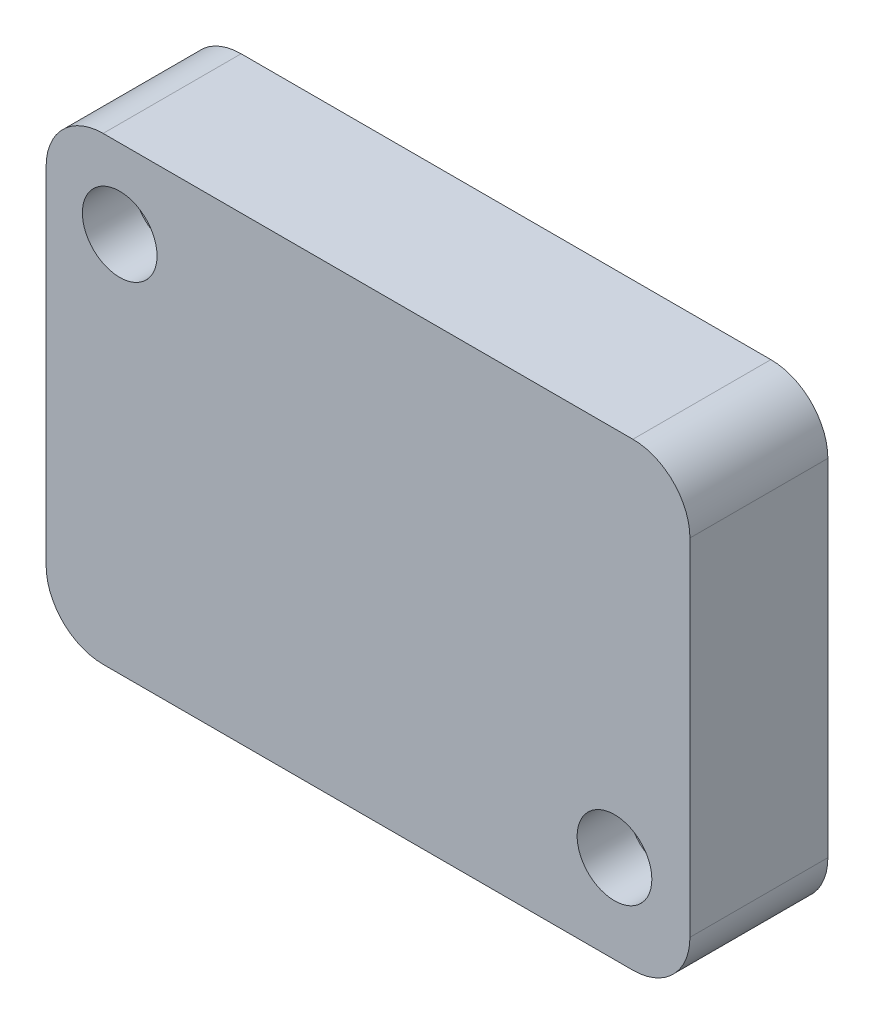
ISO-10303-21;
HEADER;
FILE_DESCRIPTION(('STEP AP214'),'2;1');
FILE_NAME('part.step','',(''),(''),'','','');
FILE_SCHEMA(('AUTOMOTIVE_DESIGN { 1 0 10303 214 1 1 1 1 }'));
ENDSEC;
DATA;
#1=APPLICATION_CONTEXT('core data for automotive mechanical design processes');
#2=APPLICATION_PROTOCOL_DEFINITION('international standard','automotive_design',2000,#1);
#3=PRODUCT_CONTEXT('',#1,'mechanical');
#4=PRODUCT('Part','Part','',(#3));
#5=PRODUCT_RELATED_PRODUCT_CATEGORY('part','',(#4));
#6=PRODUCT_DEFINITION_FORMATION('','',#4);
#7=PRODUCT_DEFINITION_CONTEXT('part definition',#1,'design');
#8=PRODUCT_DEFINITION('design','',#6,#7);
#9=PRODUCT_DEFINITION_SHAPE('','',#8);
#10=(LENGTH_UNIT() NAMED_UNIT(*) SI_UNIT(.MILLI.,.METRE.));
#11=(NAMED_UNIT(*) PLANE_ANGLE_UNIT() SI_UNIT($,.RADIAN.));
#12=(NAMED_UNIT(*) SI_UNIT($,.STERADIAN.) SOLID_ANGLE_UNIT());
#13=UNCERTAINTY_MEASURE_WITH_UNIT(LENGTH_MEASURE(1.E-05),#10,'distance_accuracy_value','');
#14=(GEOMETRIC_REPRESENTATION_CONTEXT(3) GLOBAL_UNCERTAINTY_ASSIGNED_CONTEXT((#13)) GLOBAL_UNIT_ASSIGNED_CONTEXT((#10,
#11,#12)) REPRESENTATION_CONTEXT('',''));
#15=CARTESIAN_POINT('',(0.,0.,0.));
#16=DIRECTION('',(0.,0.,1.));
#17=DIRECTION('',(1.,0.,0.));
#18=AXIS2_PLACEMENT_3D('',#15,#16,#17);
#19=CARTESIAN_POINT('',(-81.026,55.626,19.05));
#20=DIRECTION('',(0.,0.,-1.));
#21=DIRECTION('',(-1.,0.,0.));
#22=AXIS2_PLACEMENT_3D('',#19,#20,#21);
#23=CYLINDRICAL_SURFACE('',#22,7.874);
#24=CARTESIAN_POINT('',(-81.026,55.626,0.));
#25=DIRECTION('',(0.,0.,1.));
#26=DIRECTION('',(1.,0.,0.));
#27=AXIS2_PLACEMENT_3D('',#24,#25,#26);
#28=CIRCLE('',#27,7.874);
#29=CARTESIAN_POINT('',(-81.026,63.5,0.));
#30=VERTEX_POINT('',#29);
#31=CARTESIAN_POINT('',(-88.9,55.626,0.));
#32=VERTEX_POINT('',#31);
#33=EDGE_CURVE('E104',#30,#32,#28,.T.);
#34=ORIENTED_EDGE('',*,*,#33,.T.);
#35=DIRECTION('',(0.,0.,-1.));
#36=VECTOR('',#35,1.);
#37=CARTESIAN_POINT('',(-88.9,55.626,19.05));
#38=LINE('',#37,#36);
#39=CARTESIAN_POINT('',(-88.9,55.626,19.05));
#40=VERTEX_POINT('',#39);
#41=EDGE_CURVE('E11',#40,#32,#38,.T.);
#42=ORIENTED_EDGE('',*,*,#41,.F.);
#43=CARTESIAN_POINT('',(-81.026,55.626,19.05));
#44=DIRECTION('',(0.,0.,1.));
#45=DIRECTION('',(1.,0.,0.));
#46=AXIS2_PLACEMENT_3D('',#43,#44,#45);
#47=CIRCLE('',#46,7.874);
#48=CARTESIAN_POINT('',(-81.026,63.5,19.05));
#49=VERTEX_POINT('',#48);
#50=EDGE_CURVE('E136',#49,#40,#47,.T.);
#51=ORIENTED_EDGE('',*,*,#50,.F.);
#52=DIRECTION('',(0.,0.,-1.));
#53=VECTOR('',#52,1.);
#54=CARTESIAN_POINT('',(-81.026,63.5,19.05));
#55=LINE('',#54,#53);
#56=EDGE_CURVE('E117',#49,#30,#55,.T.);
#57=ORIENTED_EDGE('',*,*,#56,.T.);
#58=EDGE_LOOP('',(#34,#42,#51,#57));
#59=FACE_BOUND('',#58,.T.);
#60=ADVANCED_FACE('F36',(#59),#23,.T.);
#61=CARTESIAN_POINT('',(-88.9,55.626,19.05));
#62=DIRECTION('',(1.,0.,0.));
#63=DIRECTION('',(0.,1.,0.));
#64=AXIS2_PLACEMENT_3D('',#61,#62,#63);
#65=PLANE('',#64);
#66=DIRECTION('',(0.,-1.,0.));
#67=VECTOR('',#66,1.);
#68=CARTESIAN_POINT('',(-88.9,55.626,0.));
#69=LINE('',#68,#67);
#70=CARTESIAN_POINT('',(-88.9,7.874,0.));
#71=VERTEX_POINT('',#70);
#72=EDGE_CURVE('E100',#32,#71,#69,.T.);
#73=ORIENTED_EDGE('',*,*,#72,.T.);
#74=DIRECTION('',(0.,0.,-1.));
#75=VECTOR('',#74,1.);
#76=CARTESIAN_POINT('',(-88.9,7.874,19.05));
#77=LINE('',#76,#75);
#78=CARTESIAN_POINT('',(-88.9,7.874,19.05));
#79=VERTEX_POINT('',#78);
#80=EDGE_CURVE('E43',#79,#71,#77,.T.);
#81=ORIENTED_EDGE('',*,*,#80,.F.);
#82=DIRECTION('',(0.,-1.,0.));
#83=VECTOR('',#82,1.);
#84=CARTESIAN_POINT('',(-88.9,55.626,19.05));
#85=LINE('',#84,#83);
#86=EDGE_CURVE('E113',#40,#79,#85,.T.);
#87=ORIENTED_EDGE('',*,*,#86,.F.);
#88=ORIENTED_EDGE('',*,*,#41,.T.);
#89=EDGE_LOOP('',(#73,#81,#87,#88));
#90=FACE_BOUND('',#89,.T.);
#91=ADVANCED_FACE('F112',(#90),#65,.F.);
#92=CARTESIAN_POINT('',(-81.026,7.874,19.05));
#93=DIRECTION('',(0.,0.,-1.));
#94=DIRECTION('',(-1.,0.,0.));
#95=AXIS2_PLACEMENT_3D('',#92,#93,#94);
#96=CYLINDRICAL_SURFACE('',#95,7.874);
#97=CARTESIAN_POINT('',(-81.026,7.874,0.));
#98=DIRECTION('',(0.,0.,1.));
#99=DIRECTION('',(1.,0.,0.));
#100=AXIS2_PLACEMENT_3D('',#97,#98,#99);
#101=CIRCLE('',#100,7.874);
#102=CARTESIAN_POINT('',(-81.026,0.,0.));
#103=VERTEX_POINT('',#102);
#104=EDGE_CURVE('E106',#71,#103,#101,.T.);
#105=ORIENTED_EDGE('',*,*,#104,.T.);
#106=DIRECTION('',(0.,0.,-1.));
#107=VECTOR('',#106,1.);
#108=CARTESIAN_POINT('',(-81.026,0.,19.05));
#109=LINE('',#108,#107);
#110=CARTESIAN_POINT('',(-81.026,0.,19.05));
#111=VERTEX_POINT('',#110);
#112=EDGE_CURVE('E162',#111,#103,#109,.T.);
#113=ORIENTED_EDGE('',*,*,#112,.F.);
#114=CARTESIAN_POINT('',(-81.026,7.874,19.05));
#115=DIRECTION('',(0.,0.,1.));
#116=DIRECTION('',(1.,0.,0.));
#117=AXIS2_PLACEMENT_3D('',#114,#115,#116);
#118=CIRCLE('',#117,7.874);
#119=EDGE_CURVE('E139',#79,#111,#118,.T.);
#120=ORIENTED_EDGE('',*,*,#119,.F.);
#121=ORIENTED_EDGE('',*,*,#80,.T.);
#122=EDGE_LOOP('',(#105,#113,#120,#121));
#123=FACE_BOUND('',#122,.T.);
#124=ADVANCED_FACE('F166',(#123),#96,.T.);
#125=CARTESIAN_POINT('',(-81.026,0.,19.05));
#126=DIRECTION('',(0.,1.,0.));
#127=DIRECTION('',(0.,0.,1.));
#128=AXIS2_PLACEMENT_3D('',#125,#126,#127);
#129=PLANE('',#128);
#130=DIRECTION('',(1.,0.,0.));
#131=VECTOR('',#130,1.);
#132=CARTESIAN_POINT('',(-81.026,0.,0.));
#133=LINE('',#132,#131);
#134=CARTESIAN_POINT('',(-7.87399999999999,0.,0.));
#135=VERTEX_POINT('',#134);
#136=EDGE_CURVE('E126',#103,#135,#133,.T.);
#137=ORIENTED_EDGE('',*,*,#136,.T.);
#138=DIRECTION('',(0.,0.,-1.));
#139=VECTOR('',#138,1.);
#140=CARTESIAN_POINT('',(-7.87399999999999,0.,19.05));
#141=LINE('',#140,#139);
#142=CARTESIAN_POINT('',(-7.87399999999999,0.,19.05));
#143=VERTEX_POINT('',#142);
#144=EDGE_CURVE('E159',#143,#135,#141,.T.);
#145=ORIENTED_EDGE('',*,*,#144,.F.);
#146=DIRECTION('',(1.,0.,0.));
#147=VECTOR('',#146,1.);
#148=CARTESIAN_POINT('',(-81.026,0.,19.05));
#149=LINE('',#148,#147);
#150=EDGE_CURVE('E141',#111,#143,#149,.T.);
#151=ORIENTED_EDGE('',*,*,#150,.F.);
#152=ORIENTED_EDGE('',*,*,#112,.T.);
#153=EDGE_LOOP('',(#137,#145,#151,#152));
#154=FACE_BOUND('',#153,.T.);
#155=ADVANCED_FACE('F174',(#154),#129,.F.);
#156=CARTESIAN_POINT('',(-7.87399999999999,7.87399999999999,19.05));
#157=DIRECTION('',(0.,0.,-1.));
#158=DIRECTION('',(-1.,0.,0.));
#159=AXIS2_PLACEMENT_3D('',#156,#157,#158);
#160=CYLINDRICAL_SURFACE('',#159,7.874);
#161=CARTESIAN_POINT('',(-7.87399999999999,7.87399999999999,0.));
#162=DIRECTION('',(0.,0.,1.));
#163=DIRECTION('',(1.,0.,0.));
#164=AXIS2_PLACEMENT_3D('',#161,#162,#163);
#165=CIRCLE('',#164,7.874);
#166=CARTESIAN_POINT('',(0.,7.87399999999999,0.));
#167=VERTEX_POINT('',#166);
#168=EDGE_CURVE('E128',#135,#167,#165,.T.);
#169=ORIENTED_EDGE('',*,*,#168,.T.);
#170=DIRECTION('',(0.,0.,-1.));
#171=VECTOR('',#170,1.);
#172=CARTESIAN_POINT('',(0.,7.87399999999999,19.05));
#173=LINE('',#172,#171);
#174=CARTESIAN_POINT('',(0.,7.87399999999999,19.05));
#175=VERTEX_POINT('',#174);
#176=EDGE_CURVE('E156',#175,#167,#173,.T.);
#177=ORIENTED_EDGE('',*,*,#176,.F.);
#178=CARTESIAN_POINT('',(-7.87399999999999,7.87399999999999,19.05));
#179=DIRECTION('',(0.,0.,1.));
#180=DIRECTION('',(1.,0.,0.));
#181=AXIS2_PLACEMENT_3D('',#178,#179,#180);
#182=CIRCLE('',#181,7.874);
#183=EDGE_CURVE('E143',#143,#175,#182,.T.);
#184=ORIENTED_EDGE('',*,*,#183,.F.);
#185=ORIENTED_EDGE('',*,*,#144,.T.);
#186=EDGE_LOOP('',(#169,#177,#184,#185));
#187=FACE_BOUND('',#186,.T.);
#188=ADVANCED_FACE('F177',(#187),#160,.T.);
#189=CARTESIAN_POINT('',(0.,55.626,19.05));
#190=DIRECTION('',(-1.,0.,0.));
#191=DIRECTION('',(0.,-1.,0.));
#192=AXIS2_PLACEMENT_3D('',#189,#190,#191);
#193=PLANE('',#192);
#194=DIRECTION('',(0.,1.,0.));
#195=VECTOR('',#194,1.);
#196=CARTESIAN_POINT('',(0.,55.626,0.));
#197=LINE('',#196,#195);
#198=CARTESIAN_POINT('',(0.,55.626,0.));
#199=VERTEX_POINT('',#198);
#200=EDGE_CURVE('E130',#167,#199,#197,.T.);
#201=ORIENTED_EDGE('',*,*,#200,.T.);
#202=DIRECTION('',(0.,0.,-1.));
#203=VECTOR('',#202,1.);
#204=CARTESIAN_POINT('',(0.,55.626,19.05));
#205=LINE('',#204,#203);
#206=CARTESIAN_POINT('',(0.,55.626,19.05));
#207=VERTEX_POINT('',#206);
#208=EDGE_CURVE('E153',#207,#199,#205,.T.);
#209=ORIENTED_EDGE('',*,*,#208,.F.);
#210=DIRECTION('',(0.,1.,0.));
#211=VECTOR('',#210,1.);
#212=CARTESIAN_POINT('',(0.,55.626,19.05));
#213=LINE('',#212,#211);
#214=EDGE_CURVE('E145',#175,#207,#213,.T.);
#215=ORIENTED_EDGE('',*,*,#214,.F.);
#216=ORIENTED_EDGE('',*,*,#176,.T.);
#217=EDGE_LOOP('',(#201,#209,#215,#216));
#218=FACE_BOUND('',#217,.T.);
#219=ADVANCED_FACE('F182',(#218),#193,.F.);
#220=CARTESIAN_POINT('',(-7.874,55.626,19.05));
#221=DIRECTION('',(0.,0.,-1.));
#222=DIRECTION('',(-1.,0.,0.));
#223=AXIS2_PLACEMENT_3D('',#220,#221,#222);
#224=CYLINDRICAL_SURFACE('',#223,7.874);
#225=CARTESIAN_POINT('',(-7.874,55.626,0.));
#226=DIRECTION('',(0.,0.,1.));
#227=DIRECTION('',(-1.,0.,0.));
#228=AXIS2_PLACEMENT_3D('',#225,#226,#227);
#229=CIRCLE('',#228,7.874);
#230=CARTESIAN_POINT('',(-7.874,63.5,0.));
#231=VERTEX_POINT('',#230);
#232=EDGE_CURVE('E132',#199,#231,#229,.T.);
#233=ORIENTED_EDGE('',*,*,#232,.T.);
#234=DIRECTION('',(0.,0.,-1.));
#235=VECTOR('',#234,1.);
#236=CARTESIAN_POINT('',(-7.874,63.5,19.05));
#237=LINE('',#236,#235);
#238=CARTESIAN_POINT('',(-7.874,63.5,19.05));
#239=VERTEX_POINT('',#238);
#240=EDGE_CURVE('E150',#239,#231,#237,.T.);
#241=ORIENTED_EDGE('',*,*,#240,.F.);
#242=CARTESIAN_POINT('',(-7.874,55.626,19.05));
#243=DIRECTION('',(0.,0.,1.));
#244=DIRECTION('',(-1.,0.,0.));
#245=AXIS2_PLACEMENT_3D('',#242,#243,#244);
#246=CIRCLE('',#245,7.874);
#247=EDGE_CURVE('E55',#207,#239,#246,.T.);
#248=ORIENTED_EDGE('',*,*,#247,.F.);
#249=ORIENTED_EDGE('',*,*,#208,.T.);
#250=EDGE_LOOP('',(#233,#241,#248,#249));
#251=FACE_BOUND('',#250,.T.);
#252=ADVANCED_FACE('F185',(#251),#224,.T.);
#253=CARTESIAN_POINT('',(-81.026,63.5,19.05));
#254=DIRECTION('',(0.,-1.,0.));
#255=DIRECTION('',(0.,0.,-1.));
#256=AXIS2_PLACEMENT_3D('',#253,#254,#255);
#257=PLANE('',#256);
#258=DIRECTION('',(-1.,0.,0.));
#259=VECTOR('',#258,1.);
#260=CARTESIAN_POINT('',(-81.026,63.5,0.));
#261=LINE('',#260,#259);
#262=EDGE_CURVE('E134',#231,#30,#261,.T.);
#263=ORIENTED_EDGE('',*,*,#262,.T.);
#264=ORIENTED_EDGE('',*,*,#56,.F.);
#265=DIRECTION('',(-1.,0.,0.));
#266=VECTOR('',#265,1.);
#267=CARTESIAN_POINT('',(-81.026,63.5,19.05));
#268=LINE('',#267,#266);
#269=EDGE_CURVE('E50',#239,#49,#268,.T.);
#270=ORIENTED_EDGE('',*,*,#269,.F.);
#271=ORIENTED_EDGE('',*,*,#240,.T.);
#272=EDGE_LOOP('',(#263,#264,#270,#271));
#273=FACE_BOUND('',#272,.T.);
#274=ADVANCED_FACE('F187',(#273),#257,.F.);
#275=CARTESIAN_POINT('',(-81.026,55.626,19.05));
#276=DIRECTION('',(0.,0.,1.));
#277=DIRECTION('',(1.,0.,0.));
#278=AXIS2_PLACEMENT_3D('',#275,#276,#277);
#279=PLANE('',#278);
#280=CARTESIAN_POINT('',(-10.414,12.192,19.05));
#281=DIRECTION('',(0.,0.,1.));
#282=DIRECTION('',(1.,0.,0.));
#283=AXIS2_PLACEMENT_3D('',#280,#281,#282);
#284=CIRCLE('',#283,5.1562);
#285=CARTESIAN_POINT('',(-5.25779999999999,12.192,19.05));
#286=VERTEX_POINT('',#285);
#287=EDGE_CURVE('E312',#286,#286,#284,.T.);
#288=ORIENTED_EDGE('',*,*,#287,.F.);
#289=EDGE_LOOP('',(#288));
#290=FACE_BOUND('',#289,.T.);
#291=CARTESIAN_POINT('',(-78.74,52.578,19.05));
#292=DIRECTION('',(0.,0.,1.));
#293=DIRECTION('',(1.,0.,0.));
#294=AXIS2_PLACEMENT_3D('',#291,#292,#293);
#295=CIRCLE('',#294,5.1562);
#296=CARTESIAN_POINT('',(-73.5838,52.578,19.05));
#297=VERTEX_POINT('',#296);
#298=EDGE_CURVE('E118',#297,#297,#295,.T.);
#299=ORIENTED_EDGE('',*,*,#298,.F.);
#300=EDGE_LOOP('',(#299));
#301=FACE_BOUND('',#300,.T.);
#302=ORIENTED_EDGE('',*,*,#50,.T.);
#303=ORIENTED_EDGE('',*,*,#86,.T.);
#304=ORIENTED_EDGE('',*,*,#119,.T.);
#305=ORIENTED_EDGE('',*,*,#150,.T.);
#306=ORIENTED_EDGE('',*,*,#183,.T.);
#307=ORIENTED_EDGE('',*,*,#214,.T.);
#308=ORIENTED_EDGE('',*,*,#247,.T.);
#309=ORIENTED_EDGE('',*,*,#269,.T.);
#310=EDGE_LOOP('',(#302,#303,#304,#305,#306,#307,#308,#309));
#311=FACE_BOUND('',#310,.T.);
#312=ADVANCED_FACE('F169',(#290,#301,#311),#279,.T.);
#313=CARTESIAN_POINT('',(-81.026,55.626,0.));
#314=DIRECTION('',(0.,0.,1.));
#315=DIRECTION('',(1.,0.,0.));
#316=AXIS2_PLACEMENT_3D('',#313,#314,#315);
#317=PLANE('',#316);
#318=CARTESIAN_POINT('',(-10.414,12.192,0.));
#319=DIRECTION('',(0.,0.,1.));
#320=DIRECTION('',(1.,0.,0.));
#321=AXIS2_PLACEMENT_3D('',#318,#319,#320);
#322=CIRCLE('',#321,3.5687);
#323=CARTESIAN_POINT('',(-6.84529999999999,12.192,0.));
#324=VERTEX_POINT('',#323);
#325=EDGE_CURVE('E305',#324,#324,#322,.T.);
#326=ORIENTED_EDGE('',*,*,#325,.T.);
#327=EDGE_LOOP('',(#326));
#328=FACE_BOUND('',#327,.T.);
#329=CARTESIAN_POINT('',(-78.74,52.578,0.));
#330=DIRECTION('',(0.,0.,1.));
#331=DIRECTION('',(1.,0.,0.));
#332=AXIS2_PLACEMENT_3D('',#329,#330,#331);
#333=CIRCLE('',#332,3.56869999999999);
#334=CARTESIAN_POINT('',(-75.1713,52.578,0.));
#335=VERTEX_POINT('',#334);
#336=EDGE_CURVE('E318',#335,#335,#333,.T.);
#337=ORIENTED_EDGE('',*,*,#336,.T.);
#338=EDGE_LOOP('',(#337));
#339=FACE_BOUND('',#338,.T.);
#340=ORIENTED_EDGE('',*,*,#33,.F.);
#341=ORIENTED_EDGE('',*,*,#262,.F.);
#342=ORIENTED_EDGE('',*,*,#232,.F.);
#343=ORIENTED_EDGE('',*,*,#200,.F.);
#344=ORIENTED_EDGE('',*,*,#168,.F.);
#345=ORIENTED_EDGE('',*,*,#136,.F.);
#346=ORIENTED_EDGE('',*,*,#104,.F.);
#347=ORIENTED_EDGE('',*,*,#72,.F.);
#348=EDGE_LOOP('',(#340,#341,#342,#343,#344,#345,#346,#347));
#349=FACE_BOUND('',#348,.T.);
#350=ADVANCED_FACE('F101',(#328,#339,#349),#317,.F.);
#351=CARTESIAN_POINT('',(-78.74,52.578,19.05));
#352=DIRECTION('',(0.,0.,1.));
#353=DIRECTION('',(1.,0.,0.));
#354=AXIS2_PLACEMENT_3D('',#351,#352,#353);
#355=CYLINDRICAL_SURFACE('',#354,5.1562);
#356=CARTESIAN_POINT('',(-78.74,52.578,11.938));
#357=DIRECTION('',(0.,0.,1.));
#358=DIRECTION('',(1.,0.,0.));
#359=AXIS2_PLACEMENT_3D('',#356,#357,#358);
#360=CIRCLE('',#359,5.1562);
#361=CARTESIAN_POINT('',(-73.5838,52.578,11.938));
#362=VERTEX_POINT('',#361);
#363=EDGE_CURVE('E121',#362,#362,#360,.T.);
#364=ORIENTED_EDGE('',*,*,#363,.F.);
#365=EDGE_LOOP('',(#364));
#366=FACE_BOUND('',#365,.T.);
#367=ORIENTED_EDGE('',*,*,#298,.T.);
#368=EDGE_LOOP('',(#367));
#369=FACE_BOUND('',#368,.T.);
#370=ADVANCED_FACE('F238',(#366,#369),#355,.F.);
#371=CARTESIAN_POINT('',(-75.1713,52.578,11.938));
#372=DIRECTION('',(0.,0.,-1.));
#373=DIRECTION('',(-1.,0.,0.));
#374=AXIS2_PLACEMENT_3D('',#371,#372,#373);
#375=PLANE('',#374);
#376=CARTESIAN_POINT('',(-78.74,52.578,11.938));
#377=DIRECTION('',(0.,0.,1.));
#378=DIRECTION('',(1.,0.,0.));
#379=AXIS2_PLACEMENT_3D('',#376,#377,#378);
#380=CIRCLE('',#379,3.56869999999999);
#381=CARTESIAN_POINT('',(-75.1713,52.578,11.938));
#382=VERTEX_POINT('',#381);
#383=EDGE_CURVE('E321',#382,#382,#380,.T.);
#384=ORIENTED_EDGE('',*,*,#383,.F.);
#385=EDGE_LOOP('',(#384));
#386=FACE_BOUND('',#385,.T.);
#387=ORIENTED_EDGE('',*,*,#363,.T.);
#388=EDGE_LOOP('',(#387));
#389=FACE_BOUND('',#388,.T.);
#390=ADVANCED_FACE('F248',(#386,#389),#375,.F.);
#391=CARTESIAN_POINT('',(-78.74,52.578,19.05));
#392=DIRECTION('',(0.,0.,1.));
#393=DIRECTION('',(1.,0.,0.));
#394=AXIS2_PLACEMENT_3D('',#391,#392,#393);
#395=CYLINDRICAL_SURFACE('',#394,3.56869999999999);
#396=ORIENTED_EDGE('',*,*,#336,.F.);
#397=EDGE_LOOP('',(#396));
#398=FACE_BOUND('',#397,.T.);
#399=ORIENTED_EDGE('',*,*,#383,.T.);
#400=EDGE_LOOP('',(#399));
#401=FACE_BOUND('',#400,.T.);
#402=ADVANCED_FACE('F258',(#398,#401),#395,.F.);
#403=CARTESIAN_POINT('',(-10.414,12.192,19.05));
#404=DIRECTION('',(0.,0.,1.));
#405=DIRECTION('',(1.,0.,0.));
#406=AXIS2_PLACEMENT_3D('',#403,#404,#405);
#407=CYLINDRICAL_SURFACE('',#406,5.1562);
#408=CARTESIAN_POINT('',(-10.414,12.192,11.938));
#409=DIRECTION('',(0.,0.,1.));
#410=DIRECTION('',(1.,0.,0.));
#411=AXIS2_PLACEMENT_3D('',#408,#409,#410);
#412=CIRCLE('',#411,5.1562);
#413=CARTESIAN_POINT('',(-5.25779999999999,12.192,11.938));
#414=VERTEX_POINT('',#413);
#415=EDGE_CURVE('E309',#414,#414,#412,.T.);
#416=ORIENTED_EDGE('',*,*,#415,.F.);
#417=EDGE_LOOP('',(#416));
#418=FACE_BOUND('',#417,.T.);
#419=ORIENTED_EDGE('',*,*,#287,.T.);
#420=EDGE_LOOP('',(#419));
#421=FACE_BOUND('',#420,.T.);
#422=ADVANCED_FACE('F268',(#418,#421),#407,.F.);
#423=CARTESIAN_POINT('',(-6.84529999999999,12.192,11.938));
#424=DIRECTION('',(0.,0.,-1.));
#425=DIRECTION('',(-1.,0.,0.));
#426=AXIS2_PLACEMENT_3D('',#423,#424,#425);
#427=PLANE('',#426);
#428=CARTESIAN_POINT('',(-10.414,12.192,11.938));
#429=DIRECTION('',(0.,0.,1.));
#430=DIRECTION('',(1.,0.,0.));
#431=AXIS2_PLACEMENT_3D('',#428,#429,#430);
#432=CIRCLE('',#431,3.5687);
#433=CARTESIAN_POINT('',(-6.84529999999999,12.192,11.938));
#434=VERTEX_POINT('',#433);
#435=EDGE_CURVE('E308',#434,#434,#432,.T.);
#436=ORIENTED_EDGE('',*,*,#435,.F.);
#437=EDGE_LOOP('',(#436));
#438=FACE_BOUND('',#437,.T.);
#439=ORIENTED_EDGE('',*,*,#415,.T.);
#440=EDGE_LOOP('',(#439));
#441=FACE_BOUND('',#440,.T.);
#442=ADVANCED_FACE('F278',(#438,#441),#427,.F.);
#443=CARTESIAN_POINT('',(-10.414,12.192,19.05));
#444=DIRECTION('',(0.,0.,1.));
#445=DIRECTION('',(1.,0.,0.));
#446=AXIS2_PLACEMENT_3D('',#443,#444,#445);
#447=CYLINDRICAL_SURFACE('',#446,3.5687);
#448=ORIENTED_EDGE('',*,*,#325,.F.);
#449=EDGE_LOOP('',(#448));
#450=FACE_BOUND('',#449,.T.);
#451=ORIENTED_EDGE('',*,*,#435,.T.);
#452=EDGE_LOOP('',(#451));
#453=FACE_BOUND('',#452,.T.);
#454=ADVANCED_FACE('F288',(#450,#453),#447,.F.);
#455=CLOSED_SHELL('',(#60,#91,#124,#155,#188,#219,#252,#274,#312,#350,#370,#390,#402,#422,#442,#454));
#456=MANIFOLD_SOLID_BREP('B2',#455);
#457=ADVANCED_BREP_SHAPE_REPRESENTATION('',(#18,#456),#14);
#458=SHAPE_DEFINITION_REPRESENTATION(#9,#457);
ENDSEC;
END-ISO-10303-21;
